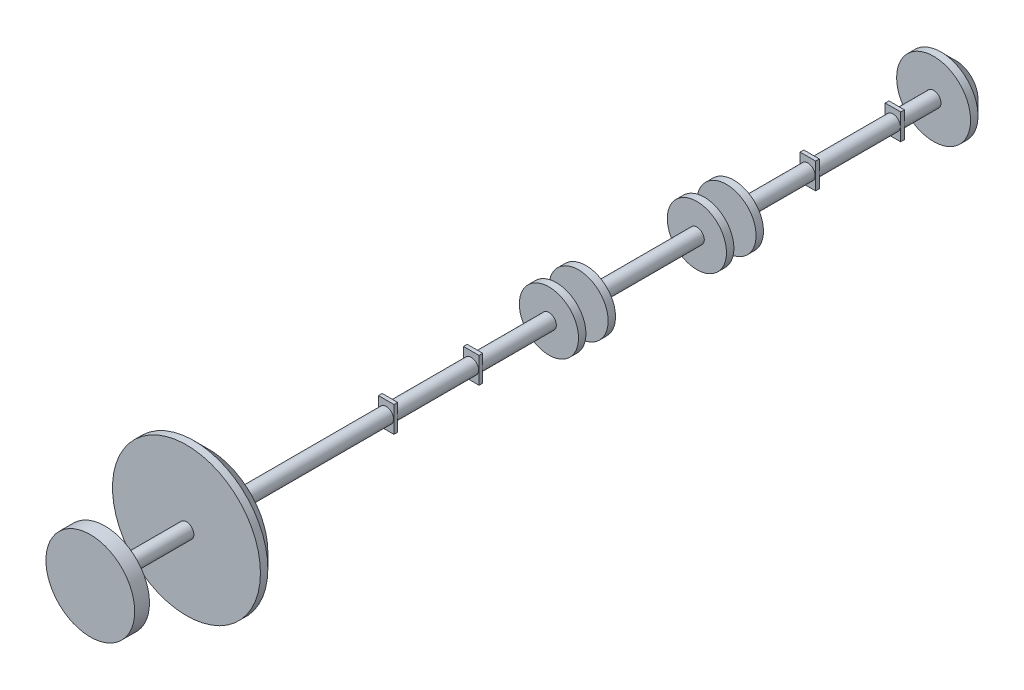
ISO-10303-21;
HEADER;
FILE_DESCRIPTION(('STEP AP214'),'2;1');
FILE_NAME('part.step','',(''),(''),'','','');
FILE_SCHEMA(('AUTOMOTIVE_DESIGN { 1 0 10303 214 1 1 1 1 }'));
ENDSEC;
DATA;
#1=APPLICATION_CONTEXT('core data for automotive mechanical design processes');
#2=APPLICATION_PROTOCOL_DEFINITION('international standard','automotive_design',2000,#1);
#3=PRODUCT_CONTEXT('',#1,'mechanical');
#4=PRODUCT('Part','Part','',(#3));
#5=PRODUCT_RELATED_PRODUCT_CATEGORY('part','',(#4));
#6=PRODUCT_DEFINITION_FORMATION('','',#4);
#7=PRODUCT_DEFINITION_CONTEXT('part definition',#1,'design');
#8=PRODUCT_DEFINITION('design','',#6,#7);
#9=PRODUCT_DEFINITION_SHAPE('','',#8);
#10=(LENGTH_UNIT() NAMED_UNIT(*) SI_UNIT(.MILLI.,.METRE.));
#11=(NAMED_UNIT(*) PLANE_ANGLE_UNIT() SI_UNIT($,.RADIAN.));
#12=(NAMED_UNIT(*) SI_UNIT($,.STERADIAN.) SOLID_ANGLE_UNIT());
#13=UNCERTAINTY_MEASURE_WITH_UNIT(LENGTH_MEASURE(1.E-05),#10,'distance_accuracy_value','');
#14=(GEOMETRIC_REPRESENTATION_CONTEXT(3) GLOBAL_UNCERTAINTY_ASSIGNED_CONTEXT((#13)) GLOBAL_UNIT_ASSIGNED_CONTEXT((#10,
#11,#12)) REPRESENTATION_CONTEXT('',''));
#15=CARTESIAN_POINT('',(0.,0.,0.));
#16=DIRECTION('',(0.,0.,1.));
#17=DIRECTION('',(1.,0.,0.));
#18=AXIS2_PLACEMENT_3D('',#15,#16,#17);
#19=CARTESIAN_POINT('',(0.,0.,-230.));
#20=DIRECTION('',(0.,0.,-1.));
#21=DIRECTION('',(-1.,0.,0.));
#22=AXIS2_PLACEMENT_3D('',#19,#20,#21);
#23=PLANE('',#22);
#24=CARTESIAN_POINT('',(0.,0.,-230.));
#25=DIRECTION('',(0.,0.,-1.));
#26=DIRECTION('',(-1.,0.,0.));
#27=AXIS2_PLACEMENT_3D('',#24,#25,#26);
#28=CIRCLE('',#27,40.);
#29=CARTESIAN_POINT('',(-40.,0.,-230.));
#30=VERTEX_POINT('',#29);
#31=EDGE_CURVE('E166',#30,#30,#28,.T.);
#32=ORIENTED_EDGE('',*,*,#31,.T.);
#33=EDGE_LOOP('',(#32));
#34=FACE_BOUND('',#33,.T.);
#35=ADVANCED_FACE('F41',(#34),#23,.T.);
#36=CARTESIAN_POINT('',(0.,0.,270.));
#37=DIRECTION('',(0.,0.,1.));
#38=DIRECTION('',(1.,0.,0.));
#39=AXIS2_PLACEMENT_3D('',#36,#37,#38);
#40=PLANE('',#39);
#41=CARTESIAN_POINT('',(0.,0.,270.));
#42=DIRECTION('',(0.,0.,1.));
#43=DIRECTION('',(1.,0.,0.));
#44=AXIS2_PLACEMENT_3D('',#41,#42,#43);
#45=CIRCLE('',#44,100.);
#46=CARTESIAN_POINT('',(100.,0.,270.));
#47=VERTEX_POINT('',#46);
#48=EDGE_CURVE('E169',#47,#47,#45,.T.);
#49=ORIENTED_EDGE('',*,*,#48,.T.);
#50=EDGE_LOOP('',(#49));
#51=FACE_BOUND('',#50,.T.);
#52=CARTESIAN_POINT('',(0.,0.,270.));
#53=DIRECTION('',(0.,0.,1.));
#54=DIRECTION('',(1.,0.,0.));
#55=AXIS2_PLACEMENT_3D('',#52,#53,#54);
#56=CIRCLE('',#55,10.);
#57=CARTESIAN_POINT('',(10.,0.,270.));
#58=VERTEX_POINT('',#57);
#59=EDGE_CURVE('E151',#58,#58,#56,.T.);
#60=ORIENTED_EDGE('',*,*,#59,.F.);
#61=EDGE_LOOP('',(#60));
#62=FACE_BOUND('',#61,.T.);
#63=ADVANCED_FACE('F232',(#51,#62),#40,.T.);
#64=CARTESIAN_POINT('',(10.5,17.5,-120.));
#65=DIRECTION('',(0.,0.,-1.));
#66=DIRECTION('',(-1.,0.,0.));
#67=AXIS2_PLACEMENT_3D('',#64,#65,#66);
#68=PLANE('',#67);
#69=DIRECTION('',(1.,0.,0.));
#70=VECTOR('',#69,1.);
#71=CARTESIAN_POINT('',(-10.5,17.5,-120.));
#72=LINE('',#71,#70);
#73=CARTESIAN_POINT('',(-10.5,17.5,-120.));
#74=VERTEX_POINT('',#73);
#75=CARTESIAN_POINT('',(10.5,17.5,-120.));
#76=VERTEX_POINT('',#75);
#77=EDGE_CURVE('E182',#74,#76,#72,.T.);
#78=ORIENTED_EDGE('',*,*,#77,.T.);
#79=DIRECTION('',(0.,-1.,0.));
#80=VECTOR('',#79,1.);
#81=CARTESIAN_POINT('',(10.5,17.5,-120.));
#82=LINE('',#81,#80);
#83=CARTESIAN_POINT('',(10.5,-17.5,-120.));
#84=VERTEX_POINT('',#83);
#85=EDGE_CURVE('E201',#76,#84,#82,.T.);
#86=ORIENTED_EDGE('',*,*,#85,.T.);
#87=DIRECTION('',(-1.,0.,0.));
#88=VECTOR('',#87,1.);
#89=CARTESIAN_POINT('',(10.5,-17.5,-120.));
#90=LINE('',#89,#88);
#91=CARTESIAN_POINT('',(-10.5,-17.5,-120.));
#92=VERTEX_POINT('',#91);
#93=EDGE_CURVE('E133',#84,#92,#90,.T.);
#94=ORIENTED_EDGE('',*,*,#93,.T.);
#95=DIRECTION('',(0.,1.,0.));
#96=VECTOR('',#95,1.);
#97=CARTESIAN_POINT('',(-10.5,-17.5,-120.));
#98=LINE('',#97,#96);
#99=EDGE_CURVE('E130',#92,#74,#98,.T.);
#100=ORIENTED_EDGE('',*,*,#99,.T.);
#101=EDGE_LOOP('',(#78,#86,#94,#100));
#102=FACE_BOUND('',#101,.T.);
#103=CARTESIAN_POINT('',(0.,0.,-120.));
#104=DIRECTION('',(0.,0.,-1.));
#105=DIRECTION('',(-1.,0.,0.));
#106=AXIS2_PLACEMENT_3D('',#103,#104,#105);
#107=CIRCLE('',#106,10.);
#108=CARTESIAN_POINT('',(-10.,0.,-120.));
#109=VERTEX_POINT('',#108);
#110=EDGE_CURVE('E152',#109,#109,#107,.T.);
#111=ORIENTED_EDGE('',*,*,#110,.F.);
#112=EDGE_LOOP('',(#111));
#113=FACE_BOUND('',#112,.T.);
#114=ADVANCED_FACE('F238',(#102,#113),#68,.T.);
#115=CARTESIAN_POINT('',(10.5,-17.5,-5.));
#116=DIRECTION('',(0.,0.,-1.));
#117=DIRECTION('',(-1.,0.,0.));
#118=AXIS2_PLACEMENT_3D('',#115,#116,#117);
#119=PLANE('',#118);
#120=DIRECTION('',(0.,-1.,0.));
#121=VECTOR('',#120,1.);
#122=CARTESIAN_POINT('',(10.5,17.5,-5.));
#123=LINE('',#122,#121);
#124=CARTESIAN_POINT('',(10.5,17.5,-5.));
#125=VERTEX_POINT('',#124);
#126=CARTESIAN_POINT('',(10.5,-17.5,-5.));
#127=VERTEX_POINT('',#126);
#128=EDGE_CURVE('E109',#125,#127,#123,.T.);
#129=ORIENTED_EDGE('',*,*,#128,.T.);
#130=DIRECTION('',(-1.,0.,0.));
#131=VECTOR('',#130,1.);
#132=CARTESIAN_POINT('',(10.5,-17.5,-5.));
#133=LINE('',#132,#131);
#134=CARTESIAN_POINT('',(-10.5,-17.5,-5.));
#135=VERTEX_POINT('',#134);
#136=EDGE_CURVE('E129',#127,#135,#133,.T.);
#137=ORIENTED_EDGE('',*,*,#136,.T.);
#138=DIRECTION('',(0.,1.,0.));
#139=VECTOR('',#138,1.);
#140=CARTESIAN_POINT('',(-10.5,17.5,-5.));
#141=LINE('',#140,#139);
#142=CARTESIAN_POINT('',(-10.5,17.5,-5.));
#143=VERTEX_POINT('',#142);
#144=EDGE_CURVE('E100',#135,#143,#141,.T.);
#145=ORIENTED_EDGE('',*,*,#144,.T.);
#146=DIRECTION('',(1.,0.,0.));
#147=VECTOR('',#146,1.);
#148=CARTESIAN_POINT('',(10.5,17.5,-5.));
#149=LINE('',#148,#147);
#150=EDGE_CURVE('E104',#143,#125,#149,.T.);
#151=ORIENTED_EDGE('',*,*,#150,.T.);
#152=EDGE_LOOP('',(#129,#137,#145,#151));
#153=FACE_BOUND('',#152,.T.);
#154=CARTESIAN_POINT('',(0.,0.,-5.));
#155=DIRECTION('',(0.,0.,-1.));
#156=DIRECTION('',(-1.,0.,0.));
#157=AXIS2_PLACEMENT_3D('',#154,#155,#156);
#158=CIRCLE('',#157,10.);
#159=CARTESIAN_POINT('',(-10.,0.,-5.));
#160=VERTEX_POINT('',#159);
#161=EDGE_CURVE('E141',#160,#160,#158,.T.);
#162=ORIENTED_EDGE('',*,*,#161,.F.);
#163=EDGE_LOOP('',(#162));
#164=FACE_BOUND('',#163,.T.);
#165=ADVANCED_FACE('F106',(#153,#164),#119,.T.);
#166=CARTESIAN_POINT('',(0.,0.,240.));
#167=DIRECTION('',(0.,0.,-1.));
#168=DIRECTION('',(-1.,0.,0.));
#169=AXIS2_PLACEMENT_3D('',#166,#167,#168);
#170=CYLINDRICAL_SURFACE('',#169,10.);
#171=CARTESIAN_POINT('',(0.,0.,240.));
#172=DIRECTION('',(0.,0.,1.));
#173=DIRECTION('',(1.,0.,0.));
#174=AXIS2_PLACEMENT_3D('',#171,#172,#173);
#175=CIRCLE('',#174,10.);
#176=CARTESIAN_POINT('',(10.,0.,240.));
#177=VERTEX_POINT('',#176);
#178=EDGE_CURVE('E149',#177,#177,#175,.T.);
#179=ORIENTED_EDGE('',*,*,#178,.F.);
#180=EDGE_LOOP('',(#179));
#181=FACE_BOUND('',#180,.T.);
#182=CARTESIAN_POINT('',(0.,0.,0.));
#183=DIRECTION('',(0.,0.,-1.));
#184=DIRECTION('',(-1.,0.,0.));
#185=AXIS2_PLACEMENT_3D('',#182,#183,#184);
#186=CIRCLE('',#185,10.);
#187=CARTESIAN_POINT('',(-10.,0.,0.));
#188=VERTEX_POINT('',#187);
#189=EDGE_CURVE('E113',#188,#188,#186,.T.);
#190=ORIENTED_EDGE('',*,*,#189,.F.);
#191=EDGE_LOOP('',(#190));
#192=FACE_BOUND('',#191,.T.);
#193=ADVANCED_FACE('F43',(#181,#192),#170,.T.);
#194=CARTESIAN_POINT('',(10.5,-17.5,0.));
#195=DIRECTION('',(0.,0.,-1.));
#196=DIRECTION('',(-1.,0.,0.));
#197=AXIS2_PLACEMENT_3D('',#194,#195,#196);
#198=PLANE('',#197);
#199=DIRECTION('',(0.,-1.,0.));
#200=VECTOR('',#199,1.);
#201=CARTESIAN_POINT('',(10.5,17.5,0.));
#202=LINE('',#201,#200);
#203=CARTESIAN_POINT('',(10.5,17.5,0.));
#204=VERTEX_POINT('',#203);
#205=CARTESIAN_POINT('',(10.5,-17.5,0.));
#206=VERTEX_POINT('',#205);
#207=EDGE_CURVE('E124',#204,#206,#202,.T.);
#208=ORIENTED_EDGE('',*,*,#207,.F.);
#209=DIRECTION('',(1.,0.,0.));
#210=VECTOR('',#209,1.);
#211=CARTESIAN_POINT('',(10.5,17.5,0.));
#212=LINE('',#211,#210);
#213=CARTESIAN_POINT('',(-10.5,17.5,0.));
#214=VERTEX_POINT('',#213);
#215=EDGE_CURVE('E119',#214,#204,#212,.T.);
#216=ORIENTED_EDGE('',*,*,#215,.F.);
#217=DIRECTION('',(0.,1.,0.));
#218=VECTOR('',#217,1.);
#219=CARTESIAN_POINT('',(-10.5,17.5,0.));
#220=LINE('',#219,#218);
#221=CARTESIAN_POINT('',(-10.5,-17.5,0.));
#222=VERTEX_POINT('',#221);
#223=EDGE_CURVE('E145',#222,#214,#220,.T.);
#224=ORIENTED_EDGE('',*,*,#223,.F.);
#225=DIRECTION('',(-1.,0.,0.));
#226=VECTOR('',#225,1.);
#227=CARTESIAN_POINT('',(10.5,-17.5,0.));
#228=LINE('',#227,#226);
#229=EDGE_CURVE('E123',#206,#222,#228,.T.);
#230=ORIENTED_EDGE('',*,*,#229,.F.);
#231=EDGE_LOOP('',(#208,#216,#224,#230));
#232=FACE_BOUND('',#231,.T.);
#233=ORIENTED_EDGE('',*,*,#189,.T.);
#234=EDGE_LOOP('',(#233));
#235=FACE_BOUND('',#234,.T.);
#236=ADVANCED_FACE('F220',(#232,#235),#198,.F.);
#237=CARTESIAN_POINT('',(10.5,17.5,-5.));
#238=DIRECTION('',(-1.,0.,0.));
#239=DIRECTION('',(0.,-1.,0.));
#240=AXIS2_PLACEMENT_3D('',#237,#238,#239);
#241=PLANE('',#240);
#242=ORIENTED_EDGE('',*,*,#207,.T.);
#243=DIRECTION('',(0.,0.,1.));
#244=VECTOR('',#243,1.);
#245=CARTESIAN_POINT('',(10.5,-17.5,-5.));
#246=LINE('',#245,#244);
#247=EDGE_CURVE('E128',#127,#206,#246,.T.);
#248=ORIENTED_EDGE('',*,*,#247,.F.);
#249=ORIENTED_EDGE('',*,*,#128,.F.);
#250=DIRECTION('',(0.,0.,1.));
#251=VECTOR('',#250,1.);
#252=CARTESIAN_POINT('',(10.5,17.5,-5.));
#253=LINE('',#252,#251);
#254=EDGE_CURVE('E116',#125,#204,#253,.T.);
#255=ORIENTED_EDGE('',*,*,#254,.T.);
#256=EDGE_LOOP('',(#242,#248,#249,#255));
#257=FACE_BOUND('',#256,.T.);
#258=ADVANCED_FACE('F126',(#257),#241,.F.);
#259=CARTESIAN_POINT('',(10.5,-17.5,-5.));
#260=DIRECTION('',(0.,1.,0.));
#261=DIRECTION('',(-1.,0.,0.));
#262=AXIS2_PLACEMENT_3D('',#259,#260,#261);
#263=PLANE('',#262);
#264=ORIENTED_EDGE('',*,*,#229,.T.);
#265=DIRECTION('',(0.,0.,1.));
#266=VECTOR('',#265,1.);
#267=CARTESIAN_POINT('',(-10.5,-17.5,-5.));
#268=LINE('',#267,#266);
#269=EDGE_CURVE('E142',#135,#222,#268,.T.);
#270=ORIENTED_EDGE('',*,*,#269,.F.);
#271=ORIENTED_EDGE('',*,*,#136,.F.);
#272=ORIENTED_EDGE('',*,*,#247,.T.);
#273=EDGE_LOOP('',(#264,#270,#271,#272));
#274=FACE_BOUND('',#273,.T.);
#275=ADVANCED_FACE('F223',(#274),#263,.F.);
#276=CARTESIAN_POINT('',(-10.5,17.5,-5.));
#277=DIRECTION('',(1.,0.,0.));
#278=DIRECTION('',(0.,1.,0.));
#279=AXIS2_PLACEMENT_3D('',#276,#277,#278);
#280=PLANE('',#279);
#281=ORIENTED_EDGE('',*,*,#223,.T.);
#282=DIRECTION('',(0.,0.,1.));
#283=VECTOR('',#282,1.);
#284=CARTESIAN_POINT('',(-10.5,17.5,-5.));
#285=LINE('',#284,#283);
#286=EDGE_CURVE('E139',#143,#214,#285,.T.);
#287=ORIENTED_EDGE('',*,*,#286,.F.);
#288=ORIENTED_EDGE('',*,*,#144,.F.);
#289=ORIENTED_EDGE('',*,*,#269,.T.);
#290=EDGE_LOOP('',(#281,#287,#288,#289));
#291=FACE_BOUND('',#290,.T.);
#292=ADVANCED_FACE('F217',(#291),#280,.F.);
#293=CARTESIAN_POINT('',(10.5,17.5,-5.));
#294=DIRECTION('',(0.,-1.,0.));
#295=DIRECTION('',(1.,0.,0.));
#296=AXIS2_PLACEMENT_3D('',#293,#294,#295);
#297=PLANE('',#296);
#298=ORIENTED_EDGE('',*,*,#215,.T.);
#299=ORIENTED_EDGE('',*,*,#254,.F.);
#300=ORIENTED_EDGE('',*,*,#150,.F.);
#301=ORIENTED_EDGE('',*,*,#286,.T.);
#302=EDGE_LOOP('',(#298,#299,#300,#301));
#303=FACE_BOUND('',#302,.T.);
#304=ADVANCED_FACE('F117',(#303),#297,.F.);
#305=CARTESIAN_POINT('',(0.,0.,-115.));
#306=DIRECTION('',(0.,0.,1.));
#307=DIRECTION('',(1.,0.,0.));
#308=AXIS2_PLACEMENT_3D('',#305,#306,#307);
#309=CYLINDRICAL_SURFACE('',#308,10.);
#310=CARTESIAN_POINT('',(0.,0.,-115.));
#311=DIRECTION('',(0.,0.,-1.));
#312=DIRECTION('',(-1.,0.,0.));
#313=AXIS2_PLACEMENT_3D('',#310,#311,#312);
#314=CIRCLE('',#313,10.);
#315=CARTESIAN_POINT('',(-10.,0.,-115.));
#316=VERTEX_POINT('',#315);
#317=EDGE_CURVE('E190',#316,#316,#314,.T.);
#318=ORIENTED_EDGE('',*,*,#317,.F.);
#319=EDGE_LOOP('',(#318));
#320=FACE_BOUND('',#319,.T.);
#321=ORIENTED_EDGE('',*,*,#161,.T.);
#322=EDGE_LOOP('',(#321));
#323=FACE_BOUND('',#322,.T.);
#324=ADVANCED_FACE('F282',(#320,#323),#309,.T.);
#325=CARTESIAN_POINT('',(10.5,17.5,-115.));
#326=DIRECTION('',(0.,0.,-1.));
#327=DIRECTION('',(-1.,0.,0.));
#328=AXIS2_PLACEMENT_3D('',#325,#326,#327);
#329=PLANE('',#328);
#330=DIRECTION('',(1.,0.,0.));
#331=VECTOR('',#330,1.);
#332=CARTESIAN_POINT('',(-10.5,17.5,-115.));
#333=LINE('',#332,#331);
#334=CARTESIAN_POINT('',(-10.5,17.5,-115.));
#335=VERTEX_POINT('',#334);
#336=CARTESIAN_POINT('',(10.5,17.5,-115.));
#337=VERTEX_POINT('',#336);
#338=EDGE_CURVE('E186',#335,#337,#333,.T.);
#339=ORIENTED_EDGE('',*,*,#338,.F.);
#340=DIRECTION('',(0.,1.,0.));
#341=VECTOR('',#340,1.);
#342=CARTESIAN_POINT('',(-10.5,-17.5,-115.));
#343=LINE('',#342,#341);
#344=CARTESIAN_POINT('',(-10.5,-17.5,-115.));
#345=VERTEX_POINT('',#344);
#346=EDGE_CURVE('E58',#345,#335,#343,.T.);
#347=ORIENTED_EDGE('',*,*,#346,.F.);
#348=DIRECTION('',(-1.,0.,0.));
#349=VECTOR('',#348,1.);
#350=CARTESIAN_POINT('',(10.5,-17.5,-115.));
#351=LINE('',#350,#349);
#352=CARTESIAN_POINT('',(10.5,-17.5,-115.));
#353=VERTEX_POINT('',#352);
#354=EDGE_CURVE('E195',#353,#345,#351,.T.);
#355=ORIENTED_EDGE('',*,*,#354,.F.);
#356=DIRECTION('',(0.,-1.,0.));
#357=VECTOR('',#356,1.);
#358=CARTESIAN_POINT('',(10.5,17.5,-115.));
#359=LINE('',#358,#357);
#360=EDGE_CURVE('E191',#337,#353,#359,.T.);
#361=ORIENTED_EDGE('',*,*,#360,.F.);
#362=EDGE_LOOP('',(#339,#347,#355,#361));
#363=FACE_BOUND('',#362,.T.);
#364=ORIENTED_EDGE('',*,*,#317,.T.);
#365=EDGE_LOOP('',(#364));
#366=FACE_BOUND('',#365,.T.);
#367=ADVANCED_FACE('F278',(#363,#366),#329,.F.);
#368=CARTESIAN_POINT('',(-10.5,17.5,-120.));
#369=DIRECTION('',(0.,-1.,0.));
#370=DIRECTION('',(1.,0.,0.));
#371=AXIS2_PLACEMENT_3D('',#368,#369,#370);
#372=PLANE('',#371);
#373=ORIENTED_EDGE('',*,*,#338,.T.);
#374=DIRECTION('',(0.,0.,1.));
#375=VECTOR('',#374,1.);
#376=CARTESIAN_POINT('',(10.5,17.5,-120.));
#377=LINE('',#376,#375);
#378=EDGE_CURVE('E194',#76,#337,#377,.T.);
#379=ORIENTED_EDGE('',*,*,#378,.F.);
#380=ORIENTED_EDGE('',*,*,#77,.F.);
#381=DIRECTION('',(0.,0.,1.));
#382=VECTOR('',#381,1.);
#383=CARTESIAN_POINT('',(-10.5,17.5,-120.));
#384=LINE('',#383,#382);
#385=EDGE_CURVE('E189',#74,#335,#384,.T.);
#386=ORIENTED_EDGE('',*,*,#385,.T.);
#387=EDGE_LOOP('',(#373,#379,#380,#386));
#388=FACE_BOUND('',#387,.T.);
#389=ADVANCED_FACE('F281',(#388),#372,.F.);
#390=CARTESIAN_POINT('',(10.5,17.5,-120.));
#391=DIRECTION('',(-1.,0.,0.));
#392=DIRECTION('',(0.,-1.,0.));
#393=AXIS2_PLACEMENT_3D('',#390,#391,#392);
#394=PLANE('',#393);
#395=ORIENTED_EDGE('',*,*,#360,.T.);
#396=DIRECTION('',(0.,0.,1.));
#397=VECTOR('',#396,1.);
#398=CARTESIAN_POINT('',(10.5,-17.5,-120.));
#399=LINE('',#398,#397);
#400=EDGE_CURVE('E197',#84,#353,#399,.T.);
#401=ORIENTED_EDGE('',*,*,#400,.F.);
#402=ORIENTED_EDGE('',*,*,#85,.F.);
#403=ORIENTED_EDGE('',*,*,#378,.T.);
#404=EDGE_LOOP('',(#395,#401,#402,#403));
#405=FACE_BOUND('',#404,.T.);
#406=ADVANCED_FACE('F292',(#405),#394,.F.);
#407=CARTESIAN_POINT('',(10.5,-17.5,-120.));
#408=DIRECTION('',(0.,1.,0.));
#409=DIRECTION('',(-1.,0.,0.));
#410=AXIS2_PLACEMENT_3D('',#407,#408,#409);
#411=PLANE('',#410);
#412=ORIENTED_EDGE('',*,*,#354,.T.);
#413=DIRECTION('',(0.,0.,1.));
#414=VECTOR('',#413,1.);
#415=CARTESIAN_POINT('',(-10.5,-17.5,-120.));
#416=LINE('',#415,#414);
#417=EDGE_CURVE('E184',#92,#345,#416,.T.);
#418=ORIENTED_EDGE('',*,*,#417,.F.);
#419=ORIENTED_EDGE('',*,*,#93,.F.);
#420=ORIENTED_EDGE('',*,*,#400,.T.);
#421=EDGE_LOOP('',(#412,#418,#419,#420));
#422=FACE_BOUND('',#421,.T.);
#423=ADVANCED_FACE('F289',(#422),#411,.F.);
#424=CARTESIAN_POINT('',(-10.5,-17.5,-120.));
#425=DIRECTION('',(1.,0.,0.));
#426=DIRECTION('',(0.,1.,0.));
#427=AXIS2_PLACEMENT_3D('',#424,#425,#426);
#428=PLANE('',#427);
#429=ORIENTED_EDGE('',*,*,#346,.T.);
#430=ORIENTED_EDGE('',*,*,#385,.F.);
#431=ORIENTED_EDGE('',*,*,#99,.F.);
#432=ORIENTED_EDGE('',*,*,#417,.T.);
#433=EDGE_LOOP('',(#429,#430,#431,#432));
#434=FACE_BOUND('',#433,.T.);
#435=ADVANCED_FACE('F276',(#434),#428,.F.);
#436=CARTESIAN_POINT('',(0.,0.,-220.));
#437=DIRECTION('',(0.,0.,1.));
#438=DIRECTION('',(1.,0.,0.));
#439=AXIS2_PLACEMENT_3D('',#436,#437,#438);
#440=CYLINDRICAL_SURFACE('',#439,10.);
#441=CARTESIAN_POINT('',(0.,0.,-220.));
#442=DIRECTION('',(0.,0.,-1.));
#443=DIRECTION('',(-1.,0.,0.));
#444=AXIS2_PLACEMENT_3D('',#441,#442,#443);
#445=CIRCLE('',#444,10.);
#446=CARTESIAN_POINT('',(-10.,0.,-220.));
#447=VERTEX_POINT('',#446);
#448=EDGE_CURVE('E158',#447,#447,#445,.T.);
#449=ORIENTED_EDGE('',*,*,#448,.F.);
#450=EDGE_LOOP('',(#449));
#451=FACE_BOUND('',#450,.T.);
#452=ORIENTED_EDGE('',*,*,#110,.T.);
#453=EDGE_LOOP('',(#452));
#454=FACE_BOUND('',#453,.T.);
#455=ADVANCED_FACE('F269',(#451,#454),#440,.T.);
#456=CARTESIAN_POINT('',(0.,0.,240.));
#457=DIRECTION('',(0.,0.,1.));
#458=DIRECTION('',(1.,0.,0.));
#459=AXIS2_PLACEMENT_3D('',#456,#457,#458);
#460=PLANE('',#459);
#461=CARTESIAN_POINT('',(0.,0.,240.));
#462=DIRECTION('',(0.,0.,1.));
#463=DIRECTION('',(1.,0.,0.));
#464=AXIS2_PLACEMENT_3D('',#461,#462,#463);
#465=CIRCLE('',#464,79.9999999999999);
#466=CARTESIAN_POINT('',(79.9999999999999,0.,240.));
#467=VERTEX_POINT('',#466);
#468=EDGE_CURVE('E12',#467,#467,#465,.F.);
#469=ORIENTED_EDGE('',*,*,#468,.T.);
#470=EDGE_LOOP('',(#469));
#471=FACE_BOUND('',#470,.T.);
#472=ORIENTED_EDGE('',*,*,#178,.T.);
#473=EDGE_LOOP('',(#472));
#474=FACE_BOUND('',#473,.T.);
#475=ADVANCED_FACE('F267',(#471,#474),#460,.F.);
#476=CARTESIAN_POINT('',(0.,0.,270.));
#477=DIRECTION('',(0.,0.,-1.));
#478=DIRECTION('',(-1.,0.,0.));
#479=AXIS2_PLACEMENT_3D('',#476,#477,#478);
#480=CYLINDRICAL_SURFACE('',#479,100.);
#481=CARTESIAN_POINT('',(0.,0.,260.));
#482=DIRECTION('',(0.,0.,1.));
#483=DIRECTION('',(1.,0.,0.));
#484=AXIS2_PLACEMENT_3D('',#481,#482,#483);
#485=CIRCLE('',#484,100.);
#486=CARTESIAN_POINT('',(100.,0.,260.));
#487=VERTEX_POINT('',#486);
#488=EDGE_CURVE('E50',#487,#487,#485,.T.);
#489=ORIENTED_EDGE('',*,*,#488,.T.);
#490=EDGE_LOOP('',(#489));
#491=FACE_BOUND('',#490,.T.);
#492=ORIENTED_EDGE('',*,*,#48,.F.);
#493=EDGE_LOOP('',(#492));
#494=FACE_BOUND('',#493,.T.);
#495=ADVANCED_FACE('F265',(#491,#494),#480,.T.);
#496=CARTESIAN_POINT('',(0.,0.,380.));
#497=DIRECTION('',(0.,0.,-1.));
#498=DIRECTION('',(-1.,0.,0.));
#499=AXIS2_PLACEMENT_3D('',#496,#497,#498);
#500=CYLINDRICAL_SURFACE('',#499,10.);
#501=CARTESIAN_POINT('',(0.,0.,380.));
#502=DIRECTION('',(0.,0.,1.));
#503=DIRECTION('',(1.,0.,0.));
#504=AXIS2_PLACEMENT_3D('',#501,#502,#503);
#505=CIRCLE('',#504,10.);
#506=CARTESIAN_POINT('',(10.,0.,380.));
#507=VERTEX_POINT('',#506);
#508=EDGE_CURVE('E173',#507,#507,#505,.T.);
#509=ORIENTED_EDGE('',*,*,#508,.F.);
#510=EDGE_LOOP('',(#509));
#511=FACE_BOUND('',#510,.T.);
#512=ORIENTED_EDGE('',*,*,#59,.T.);
#513=EDGE_LOOP('',(#512));
#514=FACE_BOUND('',#513,.T.);
#515=ADVANCED_FACE('F254',(#511,#514),#500,.T.);
#516=CARTESIAN_POINT('',(0.,0.,380.));
#517=DIRECTION('',(0.,0.,1.));
#518=DIRECTION('',(1.,0.,0.));
#519=AXIS2_PLACEMENT_3D('',#516,#517,#518);
#520=PLANE('',#519);
#521=CARTESIAN_POINT('',(0.,0.,380.));
#522=DIRECTION('',(0.,0.,1.));
#523=DIRECTION('',(1.,0.,0.));
#524=AXIS2_PLACEMENT_3D('',#521,#522,#523);
#525=CIRCLE('',#524,60.);
#526=CARTESIAN_POINT('',(60.,0.,380.));
#527=VERTEX_POINT('',#526);
#528=EDGE_CURVE('E170',#527,#527,#525,.T.);
#529=ORIENTED_EDGE('',*,*,#528,.F.);
#530=EDGE_LOOP('',(#529));
#531=FACE_BOUND('',#530,.T.);
#532=ORIENTED_EDGE('',*,*,#508,.T.);
#533=EDGE_LOOP('',(#532));
#534=FACE_BOUND('',#533,.T.);
#535=ADVANCED_FACE('F250',(#531,#534),#520,.F.);
#536=CARTESIAN_POINT('',(0.,0.,400.));
#537=DIRECTION('',(0.,0.,-1.));
#538=DIRECTION('',(-1.,0.,0.));
#539=AXIS2_PLACEMENT_3D('',#536,#537,#538);
#540=CYLINDRICAL_SURFACE('',#539,60.);
#541=CARTESIAN_POINT('',(0.,0.,400.));
#542=DIRECTION('',(0.,0.,1.));
#543=DIRECTION('',(1.,0.,0.));
#544=AXIS2_PLACEMENT_3D('',#541,#542,#543);
#545=CIRCLE('',#544,60.);
#546=CARTESIAN_POINT('',(60.,0.,400.));
#547=VERTEX_POINT('',#546);
#548=EDGE_CURVE('E163',#547,#547,#545,.T.);
#549=ORIENTED_EDGE('',*,*,#548,.F.);
#550=EDGE_LOOP('',(#549));
#551=FACE_BOUND('',#550,.T.);
#552=ORIENTED_EDGE('',*,*,#528,.T.);
#553=EDGE_LOOP('',(#552));
#554=FACE_BOUND('',#553,.T.);
#555=ADVANCED_FACE('F253',(#551,#554),#540,.T.);
#556=CARTESIAN_POINT('',(0.,0.,400.));
#557=DIRECTION('',(0.,0.,1.));
#558=DIRECTION('',(1.,0.,0.));
#559=AXIS2_PLACEMENT_3D('',#556,#557,#558);
#560=PLANE('',#559);
#561=ORIENTED_EDGE('',*,*,#548,.T.);
#562=EDGE_LOOP('',(#561));
#563=FACE_BOUND('',#562,.T.);
#564=ADVANCED_FACE('F256',(#563),#560,.T.);
#565=CARTESIAN_POINT('',(0.,0.,-220.));
#566=DIRECTION('',(0.,0.,-1.));
#567=DIRECTION('',(-1.,0.,0.));
#568=AXIS2_PLACEMENT_3D('',#565,#566,#567);
#569=PLANE('',#568);
#570=CARTESIAN_POINT('',(0.,0.,-220.));
#571=DIRECTION('',(0.,0.,-1.));
#572=DIRECTION('',(-1.,0.,0.));
#573=AXIS2_PLACEMENT_3D('',#570,#571,#572);
#574=CIRCLE('',#573,40.);
#575=CARTESIAN_POINT('',(-40.,0.,-220.));
#576=VERTEX_POINT('',#575);
#577=EDGE_CURVE('E154',#576,#576,#574,.T.);
#578=ORIENTED_EDGE('',*,*,#577,.F.);
#579=EDGE_LOOP('',(#578));
#580=FACE_BOUND('',#579,.T.);
#581=ORIENTED_EDGE('',*,*,#448,.T.);
#582=EDGE_LOOP('',(#581));
#583=FACE_BOUND('',#582,.T.);
#584=ADVANCED_FACE('F243',(#580,#583),#569,.F.);
#585=CARTESIAN_POINT('',(0.,0.,-230.));
#586=DIRECTION('',(0.,0.,1.));
#587=DIRECTION('',(1.,0.,0.));
#588=AXIS2_PLACEMENT_3D('',#585,#586,#587);
#589=CYLINDRICAL_SURFACE('',#588,40.);
#590=ORIENTED_EDGE('',*,*,#31,.F.);
#591=EDGE_LOOP('',(#590));
#592=FACE_BOUND('',#591,.T.);
#593=ORIENTED_EDGE('',*,*,#577,.T.);
#594=EDGE_LOOP('',(#593));
#595=FACE_BOUND('',#594,.T.);
#596=ADVANCED_FACE('F245',(#592,#595),#589,.T.);
#597=CARTESIAN_POINT('',(0.,0.,260.));
#598=DIRECTION('',(0.,0.,1.));
#599=DIRECTION('',(1.,0.,0.));
#600=AXIS2_PLACEMENT_3D('',#597,#598,#599);
#601=CONICAL_SURFACE('',#600,100.,0.785398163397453);
#602=ORIENTED_EDGE('',*,*,#468,.F.);
#603=EDGE_LOOP('',(#602));
#604=FACE_BOUND('',#603,.T.);
#605=ORIENTED_EDGE('',*,*,#488,.F.);
#606=EDGE_LOOP('',(#605));
#607=FACE_BOUND('',#606,.T.);
#608=ADVANCED_FACE('F248',(#604,#607),#601,.T.);
#609=CLOSED_SHELL('',(#35,#63,#114,#165,#193,#236,#258,#275,#292,#304,#324,#367,#389,#406,#423,
#435,#455,#475,#495,#515,#535,#555,#564,#584,#596,#608));
#610=MANIFOLD_SOLID_BREP('B2',#609);
#611=CARTESIAN_POINT('',(0.,0.,-430.));
#612=DIRECTION('',(0.,0.,-1.));
#613=DIRECTION('',(-1.,0.,0.));
#614=AXIS2_PLACEMENT_3D('',#611,#612,#613);
#615=PLANE('',#614);
#616=CARTESIAN_POINT('',(0.,0.,-430.));
#617=DIRECTION('',(0.,0.,-1.));
#618=DIRECTION('',(-1.,0.,0.));
#619=AXIS2_PLACEMENT_3D('',#616,#617,#618);
#620=CIRCLE('',#619,40.);
#621=CARTESIAN_POINT('',(-40.,0.,-430.));
#622=VERTEX_POINT('',#621);
#623=EDGE_CURVE('E536',#622,#622,#620,.T.);
#624=ORIENTED_EDGE('',*,*,#623,.T.);
#625=EDGE_LOOP('',(#624));
#626=FACE_BOUND('',#625,.T.);
#627=ADVANCED_FACE('F516',(#626),#615,.T.);
#628=CARTESIAN_POINT('',(0.,0.,-430.));
#629=DIRECTION('',(0.,0.,1.));
#630=DIRECTION('',(1.,0.,0.));
#631=AXIS2_PLACEMENT_3D('',#628,#629,#630);
#632=CYLINDRICAL_SURFACE('',#631,40.);
#633=ORIENTED_EDGE('',*,*,#623,.F.);
#634=EDGE_LOOP('',(#633));
#635=FACE_BOUND('',#634,.T.);
#636=CARTESIAN_POINT('',(0.,0.,-420.));
#637=DIRECTION('',(0.,0.,-1.));
#638=DIRECTION('',(-1.,0.,0.));
#639=AXIS2_PLACEMENT_3D('',#636,#637,#638);
#640=CIRCLE('',#639,40.);
#641=CARTESIAN_POINT('',(-40.,0.,-420.));
#642=VERTEX_POINT('',#641);
#643=EDGE_CURVE('E40',#642,#642,#640,.T.);
#644=ORIENTED_EDGE('',*,*,#643,.T.);
#645=EDGE_LOOP('',(#644));
#646=FACE_BOUND('',#645,.T.);
#647=ADVANCED_FACE('F561',(#635,#646),#632,.T.);
#648=CARTESIAN_POINT('',(0.,0.,-420.));
#649=DIRECTION('',(0.,0.,-1.));
#650=DIRECTION('',(-1.,0.,0.));
#651=AXIS2_PLACEMENT_3D('',#648,#649,#650);
#652=PLANE('',#651);
#653=ORIENTED_EDGE('',*,*,#643,.F.);
#654=EDGE_LOOP('',(#653));
#655=FACE_BOUND('',#654,.T.);
#656=CARTESIAN_POINT('',(0.,0.,-420.));
#657=DIRECTION('',(0.,0.,-1.));
#658=DIRECTION('',(-1.,0.,0.));
#659=AXIS2_PLACEMENT_3D('',#656,#657,#658);
#660=CIRCLE('',#659,10.);
#661=CARTESIAN_POINT('',(-10.,0.,-420.));
#662=VERTEX_POINT('',#661);
#663=EDGE_CURVE('E523',#662,#662,#660,.T.);
#664=ORIENTED_EDGE('',*,*,#663,.T.);
#665=EDGE_LOOP('',(#664));
#666=FACE_BOUND('',#665,.T.);
#667=ADVANCED_FACE('F518',(#655,#666),#652,.F.);
#668=CARTESIAN_POINT('',(0.,0.,-420.));
#669=DIRECTION('',(0.,0.,1.));
#670=DIRECTION('',(1.,0.,0.));
#671=AXIS2_PLACEMENT_3D('',#668,#669,#670);
#672=CYLINDRICAL_SURFACE('',#671,10.);
#673=ORIENTED_EDGE('',*,*,#663,.F.);
#674=EDGE_LOOP('',(#673));
#675=FACE_BOUND('',#674,.T.);
#676=CARTESIAN_POINT('',(0.,0.,-270.));
#677=DIRECTION('',(0.,0.,-1.));
#678=DIRECTION('',(-1.,0.,0.));
#679=AXIS2_PLACEMENT_3D('',#676,#677,#678);
#680=CIRCLE('',#679,10.);
#681=CARTESIAN_POINT('',(-10.,0.,-270.));
#682=VERTEX_POINT('',#681);
#683=EDGE_CURVE('E527',#682,#682,#680,.T.);
#684=ORIENTED_EDGE('',*,*,#683,.T.);
#685=EDGE_LOOP('',(#684));
#686=FACE_BOUND('',#685,.T.);
#687=ADVANCED_FACE('F567',(#675,#686),#672,.T.);
#688=CARTESIAN_POINT('',(0.,0.,-270.));
#689=DIRECTION('',(0.,0.,-1.));
#690=DIRECTION('',(-1.,0.,0.));
#691=AXIS2_PLACEMENT_3D('',#688,#689,#690);
#692=PLANE('',#691);
#693=CARTESIAN_POINT('',(0.,0.,-270.));
#694=DIRECTION('',(0.,0.,-1.));
#695=DIRECTION('',(-1.,0.,0.));
#696=AXIS2_PLACEMENT_3D('',#693,#694,#695);
#697=CIRCLE('',#696,40.);
#698=CARTESIAN_POINT('',(-40.,0.,-270.));
#699=VERTEX_POINT('',#698);
#700=EDGE_CURVE('E538',#699,#699,#697,.T.);
#701=ORIENTED_EDGE('',*,*,#700,.T.);
#702=EDGE_LOOP('',(#701));
#703=FACE_BOUND('',#702,.T.);
#704=ORIENTED_EDGE('',*,*,#683,.F.);
#705=EDGE_LOOP('',(#704));
#706=FACE_BOUND('',#705,.T.);
#707=ADVANCED_FACE('F555',(#703,#706),#692,.T.);
#708=CARTESIAN_POINT('',(0.,0.,-270.));
#709=DIRECTION('',(0.,0.,1.));
#710=DIRECTION('',(1.,0.,0.));
#711=AXIS2_PLACEMENT_3D('',#708,#709,#710);
#712=CYLINDRICAL_SURFACE('',#711,40.);
#713=ORIENTED_EDGE('',*,*,#700,.F.);
#714=EDGE_LOOP('',(#713));
#715=FACE_BOUND('',#714,.T.);
#716=CARTESIAN_POINT('',(0.,0.,-260.));
#717=DIRECTION('',(0.,0.,-1.));
#718=DIRECTION('',(-1.,0.,0.));
#719=AXIS2_PLACEMENT_3D('',#716,#717,#718);
#720=CIRCLE('',#719,40.);
#721=CARTESIAN_POINT('',(-40.,0.,-260.));
#722=VERTEX_POINT('',#721);
#723=EDGE_CURVE('E532',#722,#722,#720,.T.);
#724=ORIENTED_EDGE('',*,*,#723,.T.);
#725=EDGE_LOOP('',(#724));
#726=FACE_BOUND('',#725,.T.);
#727=ADVANCED_FACE('F547',(#715,#726),#712,.T.);
#728=CARTESIAN_POINT('',(0.,0.,-260.));
#729=DIRECTION('',(0.,0.,-1.));
#730=DIRECTION('',(-1.,0.,0.));
#731=AXIS2_PLACEMENT_3D('',#728,#729,#730);
#732=PLANE('',#731);
#733=ORIENTED_EDGE('',*,*,#723,.F.);
#734=EDGE_LOOP('',(#733));
#735=FACE_BOUND('',#734,.T.);
#736=ADVANCED_FACE('F549',(#735),#732,.F.);
#737=CLOSED_SHELL('',(#627,#647,#667,#687,#707,#727,#736));
#738=MANIFOLD_SOLID_BREP('B6',#737);
#739=CARTESIAN_POINT('',(0.,0.,-770.));
#740=DIRECTION('',(0.,0.,-1.));
#741=DIRECTION('',(-1.,0.,0.));
#742=AXIS2_PLACEMENT_3D('',#739,#740,#741);
#743=PLANE('',#742);
#744=CARTESIAN_POINT('',(0.,0.,-770.));
#745=DIRECTION('',(0.,0.,-1.));
#746=DIRECTION('',(-1.,0.,0.));
#747=AXIS2_PLACEMENT_3D('',#744,#745,#746);
#748=CIRCLE('',#747,30.0000000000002);
#749=CARTESIAN_POINT('',(-30.0000000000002,0.,-770.));
#750=VERTEX_POINT('',#749);
#751=EDGE_CURVE('E630',#750,#750,#748,.T.);
#752=ORIENTED_EDGE('',*,*,#751,.T.);
#753=EDGE_LOOP('',(#752));
#754=FACE_BOUND('',#753,.T.);
#755=ADVANCED_FACE('F622',(#754),#743,.T.);
#756=CARTESIAN_POINT('',(0.,0.,-770.));
#757=DIRECTION('',(0.,0.,1.));
#758=DIRECTION('',(1.,0.,0.));
#759=AXIS2_PLACEMENT_3D('',#756,#757,#758);
#760=CONICAL_SURFACE('',#759,30.0000000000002,0.785398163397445);
#761=CARTESIAN_POINT('',(0.,0.,-750.));
#762=DIRECTION('',(0.,0.,-1.));
#763=DIRECTION('',(-1.,0.,0.));
#764=AXIS2_PLACEMENT_3D('',#761,#762,#763);
#765=CIRCLE('',#764,50.);
#766=CARTESIAN_POINT('',(-50.,0.,-750.));
#767=VERTEX_POINT('',#766);
#768=EDGE_CURVE('E514',#767,#767,#765,.F.);
#769=ORIENTED_EDGE('',*,*,#768,.F.);
#770=EDGE_LOOP('',(#769));
#771=FACE_BOUND('',#770,.T.);
#772=ORIENTED_EDGE('',*,*,#751,.F.);
#773=EDGE_LOOP('',(#772));
#774=FACE_BOUND('',#773,.T.);
#775=ADVANCED_FACE('F782',(#771,#774),#760,.T.);
#776=CARTESIAN_POINT('',(0.,0.,-770.));
#777=DIRECTION('',(0.,0.,1.));
#778=DIRECTION('',(1.,0.,0.));
#779=AXIS2_PLACEMENT_3D('',#776,#777,#778);
#780=CYLINDRICAL_SURFACE('',#779,50.);
#781=ORIENTED_EDGE('',*,*,#768,.T.);
#782=EDGE_LOOP('',(#781));
#783=FACE_BOUND('',#782,.T.);
#784=CARTESIAN_POINT('',(0.,0.,-740.));
#785=DIRECTION('',(0.,0.,-1.));
#786=DIRECTION('',(-1.,0.,0.));
#787=AXIS2_PLACEMENT_3D('',#784,#785,#786);
#788=CIRCLE('',#787,50.);
#789=CARTESIAN_POINT('',(-50.,0.,-740.));
#790=VERTEX_POINT('',#789);
#791=EDGE_CURVE('E1019',#790,#790,#788,.T.);
#792=ORIENTED_EDGE('',*,*,#791,.T.);
#793=EDGE_LOOP('',(#792));
#794=FACE_BOUND('',#793,.T.);
#795=ADVANCED_FACE('F784',(#783,#794),#780,.T.);
#796=CARTESIAN_POINT('',(0.,0.,-740.));
#797=DIRECTION('',(0.,0.,-1.));
#798=DIRECTION('',(-1.,0.,0.));
#799=AXIS2_PLACEMENT_3D('',#796,#797,#798);
#800=PLANE('',#799);
#801=ORIENTED_EDGE('',*,*,#791,.F.);
#802=EDGE_LOOP('',(#801));
#803=FACE_BOUND('',#802,.T.);
#804=CARTESIAN_POINT('',(0.,0.,-740.));
#805=DIRECTION('',(0.,0.,-1.));
#806=DIRECTION('',(-1.,0.,0.));
#807=AXIS2_PLACEMENT_3D('',#804,#805,#806);
#808=CIRCLE('',#807,10.);
#809=CARTESIAN_POINT('',(-10.,0.,-740.));
#810=VERTEX_POINT('',#809);
#811=EDGE_CURVE('E713',#810,#810,#808,.T.);
#812=ORIENTED_EDGE('',*,*,#811,.T.);
#813=EDGE_LOOP('',(#812));
#814=FACE_BOUND('',#813,.T.);
#815=ADVANCED_FACE('F791',(#803,#814),#800,.F.);
#816=CARTESIAN_POINT('',(0.,0.,-740.));
#817=DIRECTION('',(0.,0.,1.));
#818=DIRECTION('',(1.,0.,0.));
#819=AXIS2_PLACEMENT_3D('',#816,#817,#818);
#820=CYLINDRICAL_SURFACE('',#819,10.);
#821=ORIENTED_EDGE('',*,*,#811,.F.);
#822=EDGE_LOOP('',(#821));
#823=FACE_BOUND('',#822,.T.);
#824=CARTESIAN_POINT('',(0.,0.,-690.));
#825=DIRECTION('',(0.,0.,-1.));
#826=DIRECTION('',(-1.,0.,0.));
#827=AXIS2_PLACEMENT_3D('',#824,#825,#826);
#828=CIRCLE('',#827,10.);
#829=CARTESIAN_POINT('',(-10.,0.,-690.));
#830=VERTEX_POINT('',#829);
#831=EDGE_CURVE('E716',#830,#830,#828,.T.);
#832=ORIENTED_EDGE('',*,*,#831,.T.);
#833=EDGE_LOOP('',(#832));
#834=FACE_BOUND('',#833,.T.);
#835=ADVANCED_FACE('F798',(#823,#834),#820,.T.);
#836=CARTESIAN_POINT('',(-10.5,-17.5,-690.));
#837=DIRECTION('',(0.,0.,-1.));
#838=DIRECTION('',(-1.,0.,0.));
#839=AXIS2_PLACEMENT_3D('',#836,#837,#838);
#840=PLANE('',#839);
#841=DIRECTION('',(-1.,0.,0.));
#842=VECTOR('',#841,1.);
#843=CARTESIAN_POINT('',(10.5,-17.5,-690.));
#844=LINE('',#843,#842);
#845=CARTESIAN_POINT('',(10.5,-17.5,-690.));
#846=VERTEX_POINT('',#845);
#847=CARTESIAN_POINT('',(-10.5,-17.5,-690.));
#848=VERTEX_POINT('',#847);
#849=EDGE_CURVE('E723',#846,#848,#844,.T.);
#850=ORIENTED_EDGE('',*,*,#849,.T.);
#851=DIRECTION('',(0.,1.,0.));
#852=VECTOR('',#851,1.);
#853=CARTESIAN_POINT('',(-10.5,-17.5,-690.));
#854=LINE('',#853,#852);
#855=CARTESIAN_POINT('',(-10.5,17.5,-690.));
#856=VERTEX_POINT('',#855);
#857=EDGE_CURVE('E702',#848,#856,#854,.T.);
#858=ORIENTED_EDGE('',*,*,#857,.T.);
#859=DIRECTION('',(1.,0.,0.));
#860=VECTOR('',#859,1.);
#861=CARTESIAN_POINT('',(-10.5,17.5,-690.));
#862=LINE('',#861,#860);
#863=CARTESIAN_POINT('',(10.5,17.5,-690.));
#864=VERTEX_POINT('',#863);
#865=EDGE_CURVE('E726',#856,#864,#862,.T.);
#866=ORIENTED_EDGE('',*,*,#865,.T.);
#867=DIRECTION('',(0.,-1.,0.));
#868=VECTOR('',#867,1.);
#869=CARTESIAN_POINT('',(10.5,17.5,-690.));
#870=LINE('',#869,#868);
#871=EDGE_CURVE('E728',#864,#846,#870,.T.);
#872=ORIENTED_EDGE('',*,*,#871,.T.);
#873=EDGE_LOOP('',(#850,#858,#866,#872));
#874=FACE_BOUND('',#873,.T.);
#875=ORIENTED_EDGE('',*,*,#831,.F.);
#876=EDGE_LOOP('',(#875));
#877=FACE_BOUND('',#876,.T.);
#878=ADVANCED_FACE('F803',(#874,#877),#840,.T.);
#879=CARTESIAN_POINT('',(-10.5,-17.5,-690.));
#880=DIRECTION('',(1.,0.,0.));
#881=DIRECTION('',(0.,1.,0.));
#882=AXIS2_PLACEMENT_3D('',#879,#880,#881);
#883=PLANE('',#882);
#884=DIRECTION('',(0.,1.,0.));
#885=VECTOR('',#884,1.);
#886=CARTESIAN_POINT('',(-10.5,-17.5,-685.));
#887=LINE('',#886,#885);
#888=CARTESIAN_POINT('',(-10.5,-17.5,-685.));
#889=VERTEX_POINT('',#888);
#890=CARTESIAN_POINT('',(-10.5,17.5,-685.));
#891=VERTEX_POINT('',#890);
#892=EDGE_CURVE('E687',#889,#891,#887,.T.);
#893=ORIENTED_EDGE('',*,*,#892,.T.);
#894=DIRECTION('',(0.,0.,1.));
#895=VECTOR('',#894,1.);
#896=CARTESIAN_POINT('',(-10.5,17.5,-690.));
#897=LINE('',#896,#895);
#898=EDGE_CURVE('E707',#856,#891,#897,.T.);
#899=ORIENTED_EDGE('',*,*,#898,.F.);
#900=ORIENTED_EDGE('',*,*,#857,.F.);
#901=DIRECTION('',(0.,0.,1.));
#902=VECTOR('',#901,1.);
#903=CARTESIAN_POINT('',(-10.5,-17.5,-690.));
#904=LINE('',#903,#902);
#905=EDGE_CURVE('E700',#848,#889,#904,.T.);
#906=ORIENTED_EDGE('',*,*,#905,.T.);
#907=EDGE_LOOP('',(#893,#899,#900,#906));
#908=FACE_BOUND('',#907,.T.);
#909=ADVANCED_FACE('F701',(#908),#883,.F.);
#910=CARTESIAN_POINT('',(-10.5,17.5,-690.));
#911=DIRECTION('',(0.,-1.,0.));
#912=DIRECTION('',(1.,0.,0.));
#913=AXIS2_PLACEMENT_3D('',#910,#911,#912);
#914=PLANE('',#913);
#915=DIRECTION('',(1.,0.,0.));
#916=VECTOR('',#915,1.);
#917=CARTESIAN_POINT('',(-10.5,17.5,-685.));
#918=LINE('',#917,#916);
#919=CARTESIAN_POINT('',(10.5,17.5,-685.));
#920=VERTEX_POINT('',#919);
#921=EDGE_CURVE('E694',#891,#920,#918,.T.);
#922=ORIENTED_EDGE('',*,*,#921,.T.);
#923=DIRECTION('',(0.,0.,1.));
#924=VECTOR('',#923,1.);
#925=CARTESIAN_POINT('',(10.5,17.5,-690.));
#926=LINE('',#925,#924);
#927=EDGE_CURVE('E731',#864,#920,#926,.T.);
#928=ORIENTED_EDGE('',*,*,#927,.F.);
#929=ORIENTED_EDGE('',*,*,#865,.F.);
#930=ORIENTED_EDGE('',*,*,#898,.T.);
#931=EDGE_LOOP('',(#922,#928,#929,#930));
#932=FACE_BOUND('',#931,.T.);
#933=ADVANCED_FACE('F814',(#932),#914,.F.);
#934=CARTESIAN_POINT('',(10.5,17.5,-690.));
#935=DIRECTION('',(-1.,0.,0.));
#936=DIRECTION('',(0.,-1.,0.));
#937=AXIS2_PLACEMENT_3D('',#934,#935,#936);
#938=PLANE('',#937);
#939=DIRECTION('',(0.,-1.,0.));
#940=VECTOR('',#939,1.);
#941=CARTESIAN_POINT('',(10.5,17.5,-685.));
#942=LINE('',#941,#940);
#943=CARTESIAN_POINT('',(10.5,-17.5,-685.));
#944=VERTEX_POINT('',#943);
#945=EDGE_CURVE('E721',#920,#944,#942,.T.);
#946=ORIENTED_EDGE('',*,*,#945,.T.);
#947=DIRECTION('',(0.,0.,1.));
#948=VECTOR('',#947,1.);
#949=CARTESIAN_POINT('',(10.5,-17.5,-690.));
#950=LINE('',#949,#948);
#951=EDGE_CURVE('E712',#846,#944,#950,.T.);
#952=ORIENTED_EDGE('',*,*,#951,.F.);
#953=ORIENTED_EDGE('',*,*,#871,.F.);
#954=ORIENTED_EDGE('',*,*,#927,.T.);
#955=EDGE_LOOP('',(#946,#952,#953,#954));
#956=FACE_BOUND('',#955,.T.);
#957=ADVANCED_FACE('F811',(#956),#938,.F.);
#958=CARTESIAN_POINT('',(10.5,-17.5,-690.));
#959=DIRECTION('',(0.,1.,0.));
#960=DIRECTION('',(-1.,0.,0.));
#961=AXIS2_PLACEMENT_3D('',#958,#959,#960);
#962=PLANE('',#961);
#963=DIRECTION('',(-1.,0.,0.));
#964=VECTOR('',#963,1.);
#965=CARTESIAN_POINT('',(10.5,-17.5,-685.));
#966=LINE('',#965,#964);
#967=EDGE_CURVE('E693',#944,#889,#966,.T.);
#968=ORIENTED_EDGE('',*,*,#967,.T.);
#969=ORIENTED_EDGE('',*,*,#905,.F.);
#970=ORIENTED_EDGE('',*,*,#849,.F.);
#971=ORIENTED_EDGE('',*,*,#951,.T.);
#972=EDGE_LOOP('',(#968,#969,#970,#971));
#973=FACE_BOUND('',#972,.T.);
#974=ADVANCED_FACE('F710',(#973),#962,.F.);
#975=CARTESIAN_POINT('',(-10.5,-17.5,-685.));
#976=DIRECTION('',(0.,0.,-1.));
#977=DIRECTION('',(-1.,0.,0.));
#978=AXIS2_PLACEMENT_3D('',#975,#976,#977);
#979=PLANE('',#978);
#980=ORIENTED_EDGE('',*,*,#967,.F.);
#981=ORIENTED_EDGE('',*,*,#945,.F.);
#982=ORIENTED_EDGE('',*,*,#921,.F.);
#983=ORIENTED_EDGE('',*,*,#892,.F.);
#984=EDGE_LOOP('',(#980,#981,#982,#983));
#985=FACE_BOUND('',#984,.T.);
#986=CARTESIAN_POINT('',(0.,0.,-685.));
#987=DIRECTION('',(0.,0.,-1.));
#988=DIRECTION('',(-1.,0.,0.));
#989=AXIS2_PLACEMENT_3D('',#986,#987,#988);
#990=CIRCLE('',#989,10.);
#991=CARTESIAN_POINT('',(-10.,0.,-685.));
#992=VERTEX_POINT('',#991);
#993=EDGE_CURVE('E706',#992,#992,#990,.T.);
#994=ORIENTED_EDGE('',*,*,#993,.T.);
#995=EDGE_LOOP('',(#994));
#996=FACE_BOUND('',#995,.T.);
#997=ADVANCED_FACE('F689',(#985,#996),#979,.F.);
#998=CARTESIAN_POINT('',(0.,0.,-685.));
#999=DIRECTION('',(0.,0.,1.));
#1000=DIRECTION('',(1.,0.,0.));
#1001=AXIS2_PLACEMENT_3D('',#998,#999,#1000);
#1002=CYLINDRICAL_SURFACE('',#1001,10.);
#1003=ORIENTED_EDGE('',*,*,#993,.F.);
#1004=EDGE_LOOP('',(#1003));
#1005=FACE_BOUND('',#1004,.T.);
#1006=CARTESIAN_POINT('',(0.,0.,-575.));
#1007=DIRECTION('',(0.,0.,1.));
#1008=DIRECTION('',(1.,0.,0.));
#1009=AXIS2_PLACEMENT_3D('',#1006,#1007,#1008);
#1010=CIRCLE('',#1009,10.);
#1011=CARTESIAN_POINT('',(10.,0.,-575.));
#1012=VERTEX_POINT('',#1011);
#1013=EDGE_CURVE('E776',#1012,#1012,#1010,.F.);
#1014=ORIENTED_EDGE('',*,*,#1013,.T.);
#1015=EDGE_LOOP('',(#1014));
#1016=FACE_BOUND('',#1015,.T.);
#1017=ADVANCED_FACE('F807',(#1005,#1016),#1002,.T.);
#1018=CARTESIAN_POINT('',(-10.5,-17.5,-575.));
#1019=DIRECTION('',(0.,0.,1.));
#1020=DIRECTION('',(1.,0.,0.));
#1021=AXIS2_PLACEMENT_3D('',#1018,#1019,#1020);
#1022=PLANE('',#1021);
#1023=DIRECTION('',(0.,1.,0.));
#1024=VECTOR('',#1023,1.);
#1025=CARTESIAN_POINT('',(-10.5,-17.5,-575.));
#1026=LINE('',#1025,#1024);
#1027=CARTESIAN_POINT('',(-10.5,-17.5,-575.));
#1028=VERTEX_POINT('',#1027);
#1029=CARTESIAN_POINT('',(-10.5,17.5,-575.));
#1030=VERTEX_POINT('',#1029);
#1031=EDGE_CURVE('E746',#1028,#1030,#1026,.T.);
#1032=ORIENTED_EDGE('',*,*,#1031,.T.);
#1033=DIRECTION('',(1.,0.,0.));
#1034=VECTOR('',#1033,1.);
#1035=CARTESIAN_POINT('',(-10.5,17.5,-575.));
#1036=LINE('',#1035,#1034);
#1037=CARTESIAN_POINT('',(10.5,17.5,-575.));
#1038=VERTEX_POINT('',#1037);
#1039=EDGE_CURVE('E748',#1030,#1038,#1036,.T.);
#1040=ORIENTED_EDGE('',*,*,#1039,.T.);
#1041=DIRECTION('',(0.,-1.,0.));
#1042=VECTOR('',#1041,1.);
#1043=CARTESIAN_POINT('',(10.5,17.5,-575.));
#1044=LINE('',#1043,#1042);
#1045=CARTESIAN_POINT('',(10.5,-17.5,-575.));
#1046=VERTEX_POINT('',#1045);
#1047=EDGE_CURVE('E642',#1038,#1046,#1044,.T.);
#1048=ORIENTED_EDGE('',*,*,#1047,.T.);
#1049=DIRECTION('',(-1.,0.,0.));
#1050=VECTOR('',#1049,1.);
#1051=CARTESIAN_POINT('',(10.5,-17.5,-575.));
#1052=LINE('',#1051,#1050);
#1053=EDGE_CURVE('E637',#1046,#1028,#1052,.T.);
#1054=ORIENTED_EDGE('',*,*,#1053,.T.);
#1055=EDGE_LOOP('',(#1032,#1040,#1048,#1054));
#1056=FACE_BOUND('',#1055,.T.);
#1057=ORIENTED_EDGE('',*,*,#1013,.F.);
#1058=EDGE_LOOP('',(#1057));
#1059=FACE_BOUND('',#1058,.T.);
#1060=ADVANCED_FACE('F825',(#1056,#1059),#1022,.F.);
#1061=CARTESIAN_POINT('',(-10.5,17.5,-575.));
#1062=DIRECTION('',(0.,-1.,0.));
#1063=DIRECTION('',(1.,0.,0.));
#1064=AXIS2_PLACEMENT_3D('',#1061,#1062,#1063);
#1065=PLANE('',#1064);
#1066=DIRECTION('',(1.,0.,0.));
#1067=VECTOR('',#1066,1.);
#1068=CARTESIAN_POINT('',(-10.5,17.5,-570.));
#1069=LINE('',#1068,#1067);
#1070=CARTESIAN_POINT('',(-10.5,17.5,-570.));
#1071=VERTEX_POINT('',#1070);
#1072=CARTESIAN_POINT('',(10.5,17.5,-570.));
#1073=VERTEX_POINT('',#1072);
#1074=EDGE_CURVE('E740',#1071,#1073,#1069,.T.);
#1075=ORIENTED_EDGE('',*,*,#1074,.T.);
#1076=DIRECTION('',(0.,0.,1.));
#1077=VECTOR('',#1076,1.);
#1078=CARTESIAN_POINT('',(10.5,17.5,-575.));
#1079=LINE('',#1078,#1077);
#1080=EDGE_CURVE('E758',#1038,#1073,#1079,.T.);
#1081=ORIENTED_EDGE('',*,*,#1080,.F.);
#1082=ORIENTED_EDGE('',*,*,#1039,.F.);
#1083=DIRECTION('',(0.,0.,1.));
#1084=VECTOR('',#1083,1.);
#1085=CARTESIAN_POINT('',(-10.5,17.5,-575.));
#1086=LINE('',#1085,#1084);
#1087=EDGE_CURVE('E761',#1030,#1071,#1086,.T.);
#1088=ORIENTED_EDGE('',*,*,#1087,.T.);
#1089=EDGE_LOOP('',(#1075,#1081,#1082,#1088));
#1090=FACE_BOUND('',#1089,.T.);
#1091=ADVANCED_FACE('F835',(#1090),#1065,.F.);
#1092=CARTESIAN_POINT('',(10.5,17.5,-575.));
#1093=DIRECTION('',(-1.,0.,0.));
#1094=DIRECTION('',(0.,-1.,0.));
#1095=AXIS2_PLACEMENT_3D('',#1092,#1093,#1094);
#1096=PLANE('',#1095);
#1097=DIRECTION('',(0.,-1.,0.));
#1098=VECTOR('',#1097,1.);
#1099=CARTESIAN_POINT('',(10.5,17.5,-570.));
#1100=LINE('',#1099,#1098);
#1101=CARTESIAN_POINT('',(10.5,-17.5,-570.));
#1102=VERTEX_POINT('',#1101);
#1103=EDGE_CURVE('E742',#1073,#1102,#1100,.T.);
#1104=ORIENTED_EDGE('',*,*,#1103,.T.);
#1105=DIRECTION('',(0.,0.,1.));
#1106=VECTOR('',#1105,1.);
#1107=CARTESIAN_POINT('',(10.5,-17.5,-575.));
#1108=LINE('',#1107,#1106);
#1109=EDGE_CURVE('E755',#1046,#1102,#1108,.T.);
#1110=ORIENTED_EDGE('',*,*,#1109,.F.);
#1111=ORIENTED_EDGE('',*,*,#1047,.F.);
#1112=ORIENTED_EDGE('',*,*,#1080,.T.);
#1113=EDGE_LOOP('',(#1104,#1110,#1111,#1112));
#1114=FACE_BOUND('',#1113,.T.);
#1115=ADVANCED_FACE('F839',(#1114),#1096,.F.);
#1116=CARTESIAN_POINT('',(10.5,-17.5,-575.));
#1117=DIRECTION('',(0.,1.,0.));
#1118=DIRECTION('',(-1.,0.,0.));
#1119=AXIS2_PLACEMENT_3D('',#1116,#1117,#1118);
#1120=PLANE('',#1119);
#1121=DIRECTION('',(-1.,0.,0.));
#1122=VECTOR('',#1121,1.);
#1123=CARTESIAN_POINT('',(10.5,-17.5,-570.));
#1124=LINE('',#1123,#1122);
#1125=CARTESIAN_POINT('',(-10.5,-17.5,-570.));
#1126=VERTEX_POINT('',#1125);
#1127=EDGE_CURVE('E744',#1102,#1126,#1124,.T.);
#1128=ORIENTED_EDGE('',*,*,#1127,.T.);
#1129=DIRECTION('',(0.,0.,1.));
#1130=VECTOR('',#1129,1.);
#1131=CARTESIAN_POINT('',(-10.5,-17.5,-575.));
#1132=LINE('',#1131,#1130);
#1133=EDGE_CURVE('E752',#1028,#1126,#1132,.T.);
#1134=ORIENTED_EDGE('',*,*,#1133,.F.);
#1135=ORIENTED_EDGE('',*,*,#1053,.F.);
#1136=ORIENTED_EDGE('',*,*,#1109,.T.);
#1137=EDGE_LOOP('',(#1128,#1134,#1135,#1136));
#1138=FACE_BOUND('',#1137,.T.);
#1139=ADVANCED_FACE('F836',(#1138),#1120,.F.);
#1140=CARTESIAN_POINT('',(-10.5,-17.5,-575.));
#1141=DIRECTION('',(1.,0.,0.));
#1142=DIRECTION('',(0.,1.,0.));
#1143=AXIS2_PLACEMENT_3D('',#1140,#1141,#1142);
#1144=PLANE('',#1143);
#1145=DIRECTION('',(0.,1.,0.));
#1146=VECTOR('',#1145,1.);
#1147=CARTESIAN_POINT('',(-10.5,-17.5,-570.));
#1148=LINE('',#1147,#1146);
#1149=EDGE_CURVE('E737',#1126,#1071,#1148,.T.);
#1150=ORIENTED_EDGE('',*,*,#1149,.T.);
#1151=ORIENTED_EDGE('',*,*,#1087,.F.);
#1152=ORIENTED_EDGE('',*,*,#1031,.F.);
#1153=ORIENTED_EDGE('',*,*,#1133,.T.);
#1154=EDGE_LOOP('',(#1150,#1151,#1152,#1153));
#1155=FACE_BOUND('',#1154,.T.);
#1156=ADVANCED_FACE('F831',(#1155),#1144,.F.);
#1157=CARTESIAN_POINT('',(-10.5,-17.5,-570.));
#1158=DIRECTION('',(0.,0.,1.));
#1159=DIRECTION('',(1.,0.,0.));
#1160=AXIS2_PLACEMENT_3D('',#1157,#1158,#1159);
#1161=PLANE('',#1160);
#1162=ORIENTED_EDGE('',*,*,#1149,.F.);
#1163=ORIENTED_EDGE('',*,*,#1127,.F.);
#1164=ORIENTED_EDGE('',*,*,#1103,.F.);
#1165=ORIENTED_EDGE('',*,*,#1074,.F.);
#1166=EDGE_LOOP('',(#1162,#1163,#1164,#1165));
#1167=FACE_BOUND('',#1166,.T.);
#1168=CARTESIAN_POINT('',(0.,0.,-570.));
#1169=DIRECTION('',(0.,0.,-1.));
#1170=DIRECTION('',(-1.,0.,0.));
#1171=AXIS2_PLACEMENT_3D('',#1168,#1169,#1170);
#1172=CIRCLE('',#1171,10.);
#1173=CARTESIAN_POINT('',(-10.,0.,-570.));
#1174=VERTEX_POINT('',#1173);
#1175=EDGE_CURVE('E767',#1174,#1174,#1172,.T.);
#1176=ORIENTED_EDGE('',*,*,#1175,.T.);
#1177=EDGE_LOOP('',(#1176));
#1178=FACE_BOUND('',#1177,.T.);
#1179=ADVANCED_FACE('F827',(#1167,#1178),#1161,.T.);
#1180=CARTESIAN_POINT('',(0.,0.,-570.));
#1181=DIRECTION('',(0.,0.,1.));
#1182=DIRECTION('',(1.,0.,0.));
#1183=AXIS2_PLACEMENT_3D('',#1180,#1181,#1182);
#1184=CYLINDRICAL_SURFACE('',#1183,10.);
#1185=ORIENTED_EDGE('',*,*,#1175,.F.);
#1186=EDGE_LOOP('',(#1185));
#1187=FACE_BOUND('',#1186,.T.);
#1188=CARTESIAN_POINT('',(0.,0.,-470.));
#1189=DIRECTION('',(0.,0.,-1.));
#1190=DIRECTION('',(-1.,0.,0.));
#1191=AXIS2_PLACEMENT_3D('',#1188,#1189,#1190);
#1192=CIRCLE('',#1191,10.);
#1193=CARTESIAN_POINT('',(-10.,0.,-470.));
#1194=VERTEX_POINT('',#1193);
#1195=EDGE_CURVE('E764',#1194,#1194,#1192,.T.);
#1196=ORIENTED_EDGE('',*,*,#1195,.T.);
#1197=EDGE_LOOP('',(#1196));
#1198=FACE_BOUND('',#1197,.T.);
#1199=ADVANCED_FACE('F830',(#1187,#1198),#1184,.T.);
#1200=CARTESIAN_POINT('',(0.,0.,-470.));
#1201=DIRECTION('',(0.,0.,-1.));
#1202=DIRECTION('',(-1.,0.,0.));
#1203=AXIS2_PLACEMENT_3D('',#1200,#1201,#1202);
#1204=PLANE('',#1203);
#1205=CARTESIAN_POINT('',(0.,0.,-470.));
#1206=DIRECTION('',(0.,0.,-1.));
#1207=DIRECTION('',(-1.,0.,0.));
#1208=AXIS2_PLACEMENT_3D('',#1205,#1206,#1207);
#1209=CIRCLE('',#1208,40.);
#1210=CARTESIAN_POINT('',(-40.,0.,-470.));
#1211=VERTEX_POINT('',#1210);
#1212=EDGE_CURVE('E773',#1211,#1211,#1209,.T.);
#1213=ORIENTED_EDGE('',*,*,#1212,.T.);
#1214=EDGE_LOOP('',(#1213));
#1215=FACE_BOUND('',#1214,.T.);
#1216=ORIENTED_EDGE('',*,*,#1195,.F.);
#1217=EDGE_LOOP('',(#1216));
#1218=FACE_BOUND('',#1217,.T.);
#1219=ADVANCED_FACE('F852',(#1215,#1218),#1204,.T.);
#1220=CARTESIAN_POINT('',(0.,0.,-470.));
#1221=DIRECTION('',(0.,0.,1.));
#1222=DIRECTION('',(1.,0.,0.));
#1223=AXIS2_PLACEMENT_3D('',#1220,#1221,#1222);
#1224=CYLINDRICAL_SURFACE('',#1223,40.);
#1225=ORIENTED_EDGE('',*,*,#1212,.F.);
#1226=EDGE_LOOP('',(#1225));
#1227=FACE_BOUND('',#1226,.T.);
#1228=CARTESIAN_POINT('',(0.,0.,-460.));
#1229=DIRECTION('',(0.,0.,-1.));
#1230=DIRECTION('',(-1.,0.,0.));
#1231=AXIS2_PLACEMENT_3D('',#1228,#1229,#1230);
#1232=CIRCLE('',#1231,40.);
#1233=CARTESIAN_POINT('',(-40.,0.,-460.));
#1234=VERTEX_POINT('',#1233);
#1235=EDGE_CURVE('E770',#1234,#1234,#1232,.T.);
#1236=ORIENTED_EDGE('',*,*,#1235,.T.);
#1237=EDGE_LOOP('',(#1236));
#1238=FACE_BOUND('',#1237,.T.);
#1239=ADVANCED_FACE('F624',(#1227,#1238),#1224,.T.);
#1240=CARTESIAN_POINT('',(0.,0.,-460.));
#1241=DIRECTION('',(0.,0.,-1.));
#1242=DIRECTION('',(-1.,0.,0.));
#1243=AXIS2_PLACEMENT_3D('',#1240,#1241,#1242);
#1244=PLANE('',#1243);
#1245=ORIENTED_EDGE('',*,*,#1235,.F.);
#1246=EDGE_LOOP('',(#1245));
#1247=FACE_BOUND('',#1246,.T.);
#1248=ADVANCED_FACE('F854',(#1247),#1244,.F.);
#1249=CLOSED_SHELL('',(#755,#775,#795,#815,#835,#878,#909,#933,#957,#974,#997,#1017,#1060,#1091,
#1115,#1139,#1156,#1179,#1199,#1219,#1239,#1248));
#1250=MANIFOLD_SOLID_BREP('B35',#1249);
#1251=ADVANCED_BREP_SHAPE_REPRESENTATION('',(#18,#610,#738,#1250),#14);
#1252=SHAPE_DEFINITION_REPRESENTATION(#9,#1251);
ENDSEC;
END-ISO-10303-21;
